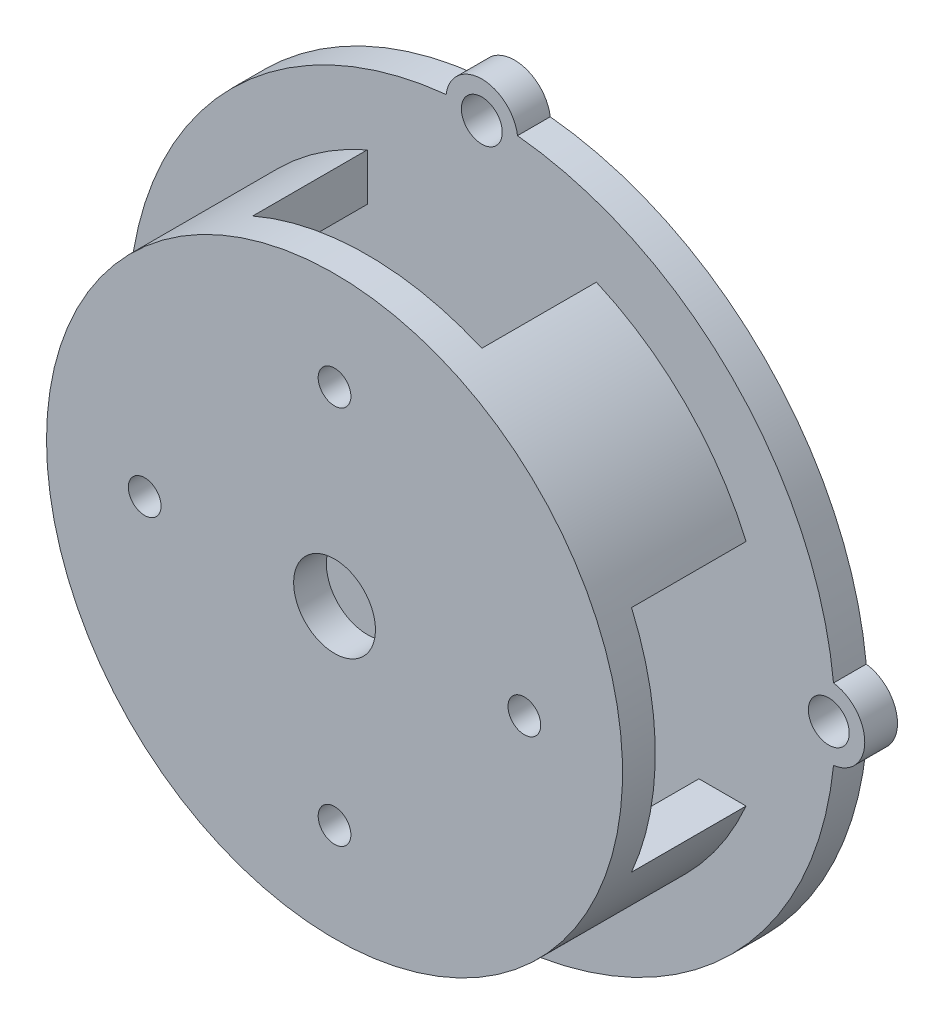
from build123d import *

# Parameters (mm, degrees)
CROQUIS1_R                 = 108
SALIENTE_EXTRUIR1_DEPTH    = 55
CROQUIS2_W                 = 20
CROQUIS2_H                 = 45
CROQUIS4_R                 = 11
SALIENTE_EXTRUIR2_DEPTH    = 10
CORTAR_EXTRUIR2_REACH      = 176.365
CROQUIS8_R                 = 6.25
CORTAR_EXTRUIR3_REACH      = 284.365
CORTAR_EXTRUIR3_START      = 108
CROQUIS9_W                 = 70
CROQUIS9_H                 = 35
CORTAR_EXTRUIR4_DEPTH      = 108
CORTAR_EXTRUIR4_DEPTH_BACK = 108
CROQUIS10_W                = 35
CROQUIS10_H                = 70
CROQUIS11_R                = 75
CORTAR_EXTRUIR5_DEPTH      = 35
CROQUIS13_R                = 92.5
CROQUIS13_R_2              = 85
SALIENTE_EXTRUIR3_DEPTH    = 10
CROQUIS14_R                = 17.5
CROQUIS14_R_2              = 12.5
SALIENTE_EXTRUIR4_DEPTH    = 5
CORTAR_EXTRUIR6_START      = -55
CROQUIS15_R                = 12.5
CORTAR_EXTRUIR6_DEPTH      = 55
CROQUIS16_R                = 5
CORTAR_EXTRUIR7_DEPTH      = 10


with BuildPart() as part:
    # Croquis1 → Saliente-Extruir1 (new body)
    with BuildSketch(Plane.XY):
        Circle(CROQUIS1_R)
    extrude(amount=SALIENTE_EXTRUIR1_DEPTH)

    # Croquis2 → Cortar-Revoluci_n1 (revolve, cut)
    with BuildSketch(Plane(origin=(0, 0, 0), x_dir=(1, 0, 0), z_dir=(0, 1, 0))):
        with Locations((-98, -32.5)):
            Rectangle(CROQUIS2_W, CROQUIS2_H)
    revolve(axis=Axis((0, 0, 0), (0, 0, 1)), mode=Mode.SUBTRACT)

    # Croquis4 → Saliente-Extruir2 (add)
    with BuildSketch(Plane(origin=(0, 0, 0), x_dir=(-1, 0, 0), z_dir=(0, 0, -1))):
        with Locations((0, 106)):
            Circle(CROQUIS4_R)
        with Locations((106, 0)):
            Circle(CROQUIS4_R)
        with Locations((0, -106)):
            Circle(CROQUIS4_R)
        with Locations((-106, 0)):
            Circle(CROQUIS4_R)
    extrude(amount=-SALIENTE_EXTRUIR2_DEPTH)

    # Croquis8 → Cortar-Extruir2 (cut, up to next)
    with BuildSketch(Plane(origin=(0, 0, 0), x_dir=(-1, 0, 0), z_dir=(0, 0, -1)), mode=Mode.PRIVATE) as cortar_extruir2_sk1:
        with Locations((0, 106)):
            Circle(CROQUIS8_R)
    cortar_extruir2_tool1 = extrude(cortar_extruir2_sk1.sketch, amount=-CORTAR_EXTRUIR2_REACH, mode=Mode.PRIVATE) & part.part
    # Croquis8 → Cortar-Extruir2 (cut, up to next)
    with BuildSketch(Plane(origin=(0, 0, 0), x_dir=(-1, 0, 0), z_dir=(0, 0, -1)), mode=Mode.PRIVATE) as cortar_extruir2_sk2:
        with Locations((106, 0)):
            Circle(CROQUIS8_R)
    cortar_extruir2_tool2 = extrude(cortar_extruir2_sk2.sketch, amount=-CORTAR_EXTRUIR2_REACH, mode=Mode.PRIVATE) & part.part
    # Croquis8 → Cortar-Extruir2 (cut, up to next)
    with BuildSketch(Plane(origin=(0, 0, 0), x_dir=(-1, 0, 0), z_dir=(0, 0, -1)), mode=Mode.PRIVATE) as cortar_extruir2_sk3:
        with Locations((0, -106)):
            Circle(CROQUIS8_R)
    cortar_extruir2_tool3 = extrude(cortar_extruir2_sk3.sketch, amount=-CORTAR_EXTRUIR2_REACH, mode=Mode.PRIVATE) & part.part
    # Croquis8 → Cortar-Extruir2 (cut, up to next)
    with BuildSketch(Plane(origin=(0, 0, 0), x_dir=(-1, 0, 0), z_dir=(0, 0, -1)), mode=Mode.PRIVATE) as cortar_extruir2_sk4:
        with Locations((-106, 0)):
            Circle(CROQUIS8_R)
    cortar_extruir2_tool4 = extrude(cortar_extruir2_sk4.sketch, amount=-CORTAR_EXTRUIR2_REACH, mode=Mode.PRIVATE) & part.part
    add(cortar_extruir2_tool1.solids().sort_by_distance((0, 106, 0))[0], mode=Mode.SUBTRACT)
    add(cortar_extruir2_tool2.solids().sort_by_distance((-106, 0, 0))[0], mode=Mode.SUBTRACT)
    add(cortar_extruir2_tool3.solids().sort_by_distance((0, -106, 0))[0], mode=Mode.SUBTRACT)
    add(cortar_extruir2_tool4.solids().sort_by_distance((106, 0, 0))[0], mode=Mode.SUBTRACT)

    # Croquis9 → Cortar-Extruir3 (cut, up to next)
    with BuildSketch(Plane(origin=(0, 0, 0), x_dir=(1, 0, 0), z_dir=(0, 1, 0)).offset(CORTAR_EXTRUIR3_START), mode=Mode.PRIVATE) as cortar_extruir3_sk1:
        with Locations((0, -27.5)):
            Rectangle(CROQUIS9_W, CROQUIS9_H)
    cortar_extruir3_tool1 = extrude(cortar_extruir3_sk1.sketch, amount=-CORTAR_EXTRUIR3_REACH, mode=Mode.PRIVATE) & part.part
    add(cortar_extruir3_tool1.solids().sort_by_distance((0, 108, 27.5))[0], mode=Mode.SUBTRACT)

    # Croquis10 → Cortar-Extruir4 (cut, two sides: drawn at the far end of the back side and taken through both)
    with BuildSketch(Plane(origin=(0, 0, 0), x_dir=(0, 0, -1), z_dir=(1, 0, 0)).offset(-CORTAR_EXTRUIR4_DEPTH_BACK)):
        with Locations((-27.5, 0)):
            Rectangle(CROQUIS10_W, CROQUIS10_H)
    extrude(amount=CORTAR_EXTRUIR4_DEPTH + CORTAR_EXTRUIR4_DEPTH_BACK, mode=Mode.SUBTRACT)

    # Croquis11 → Cortar-Extruir5 (cut)
    with BuildSketch(Plane.XY.offset(45)):
        Circle(CROQUIS11_R)
    extrude(amount=-CORTAR_EXTRUIR5_DEPTH, mode=Mode.SUBTRACT)

    # Croquis13 → Saliente-Extruir3 (add)
    with BuildSketch(Plane(origin=(0, 0, 0), x_dir=(-1, 0, 0), z_dir=(0, 0, -1))):
        with Locations(Location((0, 0, 0), (0, 0, 180))):
            Circle(CROQUIS13_R)
        Circle(CROQUIS13_R_2, mode=Mode.SUBTRACT)
    extrude(amount=SALIENTE_EXTRUIR3_DEPTH)

    # Croquis14 → Saliente-Extruir4 (add)
    with BuildSketch(Plane(origin=(0, 0, 0), x_dir=(-1, 0, 0), z_dir=(0, 0, -1))):
        with Locations(Location((0, 0, 0), (0, 0, 180))):
            Circle(CROQUIS14_R)
        Circle(CROQUIS14_R_2, mode=Mode.SUBTRACT)
    extrude(amount=SALIENTE_EXTRUIR4_DEPTH)

    # Croquis15 → Cortar-Extruir6 (cut)
    with BuildSketch(Plane(origin=(0, 0, 0), x_dir=(-1, 0, 0), z_dir=(0, 0, -1)).offset(CORTAR_EXTRUIR6_START)):
        Circle(CROQUIS15_R)
    extrude(amount=CORTAR_EXTRUIR6_DEPTH, mode=Mode.SUBTRACT)

    # Croquis16 → Cortar-Extruir7 (cut)
    with BuildSketch(Plane.XY.offset(55)):
        with Locations((0, 58)):
            Circle(CROQUIS16_R)
        with Locations((58, 0)):
            Circle(CROQUIS16_R)
        with Locations((0, -58)):
            Circle(CROQUIS16_R)
        with Locations((-58, 0)):
            Circle(CROQUIS16_R)
    extrude(amount=-CORTAR_EXTRUIR7_DEPTH, mode=Mode.SUBTRACT)


solid = part.part
